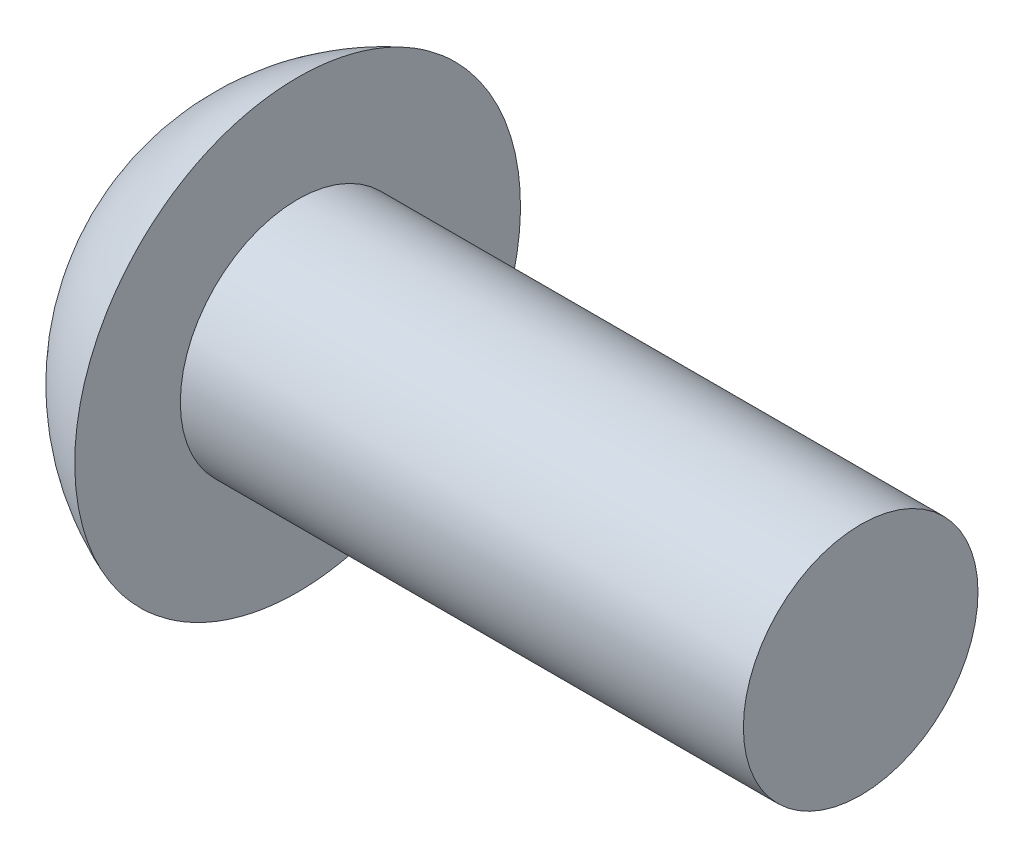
ISO-10303-21;
HEADER;
FILE_DESCRIPTION(('STEP AP214'),'2;1');
FILE_NAME('part.step','',(''),(''),'','','');
FILE_SCHEMA(('AUTOMOTIVE_DESIGN { 1 0 10303 214 1 1 1 1 }'));
ENDSEC;
DATA;
#1=APPLICATION_CONTEXT('core data for automotive mechanical design processes');
#2=APPLICATION_PROTOCOL_DEFINITION('international standard','automotive_design',2000,#1);
#3=PRODUCT_CONTEXT('',#1,'mechanical');
#4=PRODUCT('Part','Part','',(#3));
#5=PRODUCT_RELATED_PRODUCT_CATEGORY('part','',(#4));
#6=PRODUCT_DEFINITION_FORMATION('','',#4);
#7=PRODUCT_DEFINITION_CONTEXT('part definition',#1,'design');
#8=PRODUCT_DEFINITION('design','',#6,#7);
#9=PRODUCT_DEFINITION_SHAPE('','',#8);
#10=(LENGTH_UNIT() NAMED_UNIT(*) SI_UNIT(.MILLI.,.METRE.));
#11=(NAMED_UNIT(*) PLANE_ANGLE_UNIT() SI_UNIT($,.RADIAN.));
#12=(NAMED_UNIT(*) SI_UNIT($,.STERADIAN.) SOLID_ANGLE_UNIT());
#13=UNCERTAINTY_MEASURE_WITH_UNIT(LENGTH_MEASURE(1.E-05),#10,'distance_accuracy_value','');
#14=(GEOMETRIC_REPRESENTATION_CONTEXT(3) GLOBAL_UNCERTAINTY_ASSIGNED_CONTEXT((#13)) GLOBAL_UNIT_ASSIGNED_CONTEXT((#10,
#11,#12)) REPRESENTATION_CONTEXT('',''));
#15=CARTESIAN_POINT('',(0.,0.,0.));
#16=DIRECTION('',(0.,0.,1.));
#17=DIRECTION('',(1.,0.,0.));
#18=AXIS2_PLACEMENT_3D('',#15,#16,#17);
#19=CARTESIAN_POINT('',(1.56,1.5,0.866025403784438));
#20=DIRECTION('',(0.86602540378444,0.249999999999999,0.433012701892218));
#21=DIRECTION('',(0.447213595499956,0.,-0.894427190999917));
#22=AXIS2_PLACEMENT_3D('',#19,#20,#21);
#23=PLANE('',#22);
#24=DIRECTION('',(0.447213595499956,-0.774596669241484,-0.447213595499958));
#25=VECTOR('',#24,1.);
#26=CARTESIAN_POINT('',(1.56,1.5,0.866025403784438));
#27=LINE('',#26,#25);
#28=CARTESIAN_POINT('',(1.56,1.5,0.866025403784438));
#29=VERTEX_POINT('',#28);
#30=CARTESIAN_POINT('',(2.42602540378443,0.,0.));
#31=VERTEX_POINT('',#30);
#32=EDGE_CURVE('E81',#29,#31,#27,.T.);
#33=ORIENTED_EDGE('',*,*,#32,.T.);
#34=DIRECTION('',(0.447213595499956,0.,-0.894427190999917));
#35=VECTOR('',#34,1.);
#36=CARTESIAN_POINT('',(1.56,0.,1.73205080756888));
#37=LINE('',#36,#35);
#38=CARTESIAN_POINT('',(1.56,0.,1.73205080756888));
#39=VERTEX_POINT('',#38);
#40=EDGE_CURVE('E84',#31,#39,#37,.F.);
#41=ORIENTED_EDGE('',*,*,#40,.T.);
#42=DIRECTION('',(0.,-0.866025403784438,0.5));
#43=VECTOR('',#42,1.);
#44=CARTESIAN_POINT('',(1.56,1.5,0.866025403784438));
#45=LINE('',#44,#43);
#46=EDGE_CURVE('E76',#29,#39,#45,.T.);
#47=ORIENTED_EDGE('',*,*,#46,.F.);
#48=EDGE_LOOP('',(#33,#41,#47));
#49=FACE_BOUND('',#48,.T.);
#50=ADVANCED_FACE('F17',(#49),#23,.F.);
#51=CARTESIAN_POINT('',(1.56,1.5,-0.866025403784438));
#52=DIRECTION('',(0.86602540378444,0.499999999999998,0.));
#53=DIRECTION('',(-0.499999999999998,0.86602540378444,0.));
#54=AXIS2_PLACEMENT_3D('',#51,#52,#53);
#55=PLANE('',#54);
#56=DIRECTION('',(0.447213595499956,-0.774596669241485,0.447213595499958));
#57=VECTOR('',#56,1.);
#58=CARTESIAN_POINT('',(1.56,1.5,-0.866025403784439));
#59=LINE('',#58,#57);
#60=CARTESIAN_POINT('',(1.56,1.5,-0.866025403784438));
#61=VERTEX_POINT('',#60);
#62=EDGE_CURVE('E105',#61,#31,#59,.T.);
#63=ORIENTED_EDGE('',*,*,#62,.T.);
#64=ORIENTED_EDGE('',*,*,#32,.F.);
#65=DIRECTION('',(0.,0.,1.));
#66=VECTOR('',#65,1.);
#67=CARTESIAN_POINT('',(1.56,1.5,-0.866025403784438));
#68=LINE('',#67,#66);
#69=EDGE_CURVE('E90',#61,#29,#68,.T.);
#70=ORIENTED_EDGE('',*,*,#69,.F.);
#71=EDGE_LOOP('',(#63,#64,#70));
#72=FACE_BOUND('',#71,.T.);
#73=ADVANCED_FACE('F104',(#72),#55,.F.);
#74=CARTESIAN_POINT('',(1.56,0.,1.73205080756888));
#75=DIRECTION('',(0.86602540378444,-0.249999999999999,0.433012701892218));
#76=DIRECTION('',(0.447213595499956,0.,-0.894427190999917));
#77=AXIS2_PLACEMENT_3D('',#74,#75,#76);
#78=PLANE('',#77);
#79=ORIENTED_EDGE('',*,*,#40,.F.);
#80=DIRECTION('',(-0.447213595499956,-0.774596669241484,0.447213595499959));
#81=VECTOR('',#80,1.);
#82=CARTESIAN_POINT('',(2.42602540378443,0.,0.));
#83=LINE('',#82,#81);
#84=CARTESIAN_POINT('',(1.56,-1.5,0.866025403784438));
#85=VERTEX_POINT('',#84);
#86=EDGE_CURVE('E163',#31,#85,#83,.T.);
#87=ORIENTED_EDGE('',*,*,#86,.T.);
#88=DIRECTION('',(0.,-0.866025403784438,-0.5));
#89=VECTOR('',#88,1.);
#90=CARTESIAN_POINT('',(1.56,0.,1.73205080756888));
#91=LINE('',#90,#89);
#92=EDGE_CURVE('E169',#39,#85,#91,.T.);
#93=ORIENTED_EDGE('',*,*,#92,.F.);
#94=EDGE_LOOP('',(#79,#87,#93));
#95=FACE_BOUND('',#94,.T.);
#96=ADVANCED_FACE('F177',(#95),#78,.F.);
#97=CARTESIAN_POINT('',(1.56,0.,-1.73205080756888));
#98=DIRECTION('',(0.86602540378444,0.249999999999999,-0.433012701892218));
#99=DIRECTION('',(-0.447213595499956,0.,-0.894427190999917));
#100=AXIS2_PLACEMENT_3D('',#97,#98,#99);
#101=PLANE('',#100);
#102=DIRECTION('',(-0.447213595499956,0.,-0.894427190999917));
#103=VECTOR('',#102,1.);
#104=CARTESIAN_POINT('',(1.90641016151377,0.,-1.03923048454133));
#105=LINE('',#104,#103);
#106=CARTESIAN_POINT('',(1.56,0.,-1.73205080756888));
#107=VERTEX_POINT('',#106);
#108=EDGE_CURVE('E158',#107,#31,#105,.F.);
#109=ORIENTED_EDGE('',*,*,#108,.T.);
#110=ORIENTED_EDGE('',*,*,#62,.F.);
#111=DIRECTION('',(0.,0.866025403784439,0.5));
#112=VECTOR('',#111,1.);
#113=CARTESIAN_POINT('',(1.56,0.,-1.73205080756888));
#114=LINE('',#113,#112);
#115=EDGE_CURVE('E166',#107,#61,#114,.T.);
#116=ORIENTED_EDGE('',*,*,#115,.F.);
#117=EDGE_LOOP('',(#109,#110,#116));
#118=FACE_BOUND('',#117,.T.);
#119=ADVANCED_FACE('F196',(#118),#101,.F.);
#120=CARTESIAN_POINT('',(1.56,-1.5,0.866025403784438));
#121=DIRECTION('',(0.86602540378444,-0.499999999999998,0.));
#122=DIRECTION('',(0.499999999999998,0.86602540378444,0.));
#123=AXIS2_PLACEMENT_3D('',#120,#121,#122);
#124=PLANE('',#123);
#125=ORIENTED_EDGE('',*,*,#86,.F.);
#126=DIRECTION('',(-0.447213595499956,-0.774596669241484,-0.447213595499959));
#127=VECTOR('',#126,1.);
#128=CARTESIAN_POINT('',(2.42602540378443,0.,0.));
#129=LINE('',#128,#127);
#130=CARTESIAN_POINT('',(1.56,-1.5,-0.86602540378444));
#131=VERTEX_POINT('',#130);
#132=EDGE_CURVE('E155',#31,#131,#129,.T.);
#133=ORIENTED_EDGE('',*,*,#132,.T.);
#134=DIRECTION('',(0.,0.,1.));
#135=VECTOR('',#134,1.);
#136=CARTESIAN_POINT('',(1.56,-1.5,0.866025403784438));
#137=LINE('',#136,#135);
#138=EDGE_CURVE('E161',#85,#131,#137,.F.);
#139=ORIENTED_EDGE('',*,*,#138,.F.);
#140=EDGE_LOOP('',(#125,#133,#139));
#141=FACE_BOUND('',#140,.T.);
#142=ADVANCED_FACE('F184',(#141),#124,.F.);
#143=CARTESIAN_POINT('',(1.56,-1.5,-0.86602540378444));
#144=DIRECTION('',(0.86602540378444,-0.249999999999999,-0.433012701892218));
#145=DIRECTION('',(-0.447213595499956,0.,-0.894427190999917));
#146=AXIS2_PLACEMENT_3D('',#143,#144,#145);
#147=PLANE('',#146);
#148=ORIENTED_EDGE('',*,*,#132,.F.);
#149=ORIENTED_EDGE('',*,*,#108,.F.);
#150=DIRECTION('',(0.,-0.866025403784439,0.5));
#151=VECTOR('',#150,1.);
#152=CARTESIAN_POINT('',(1.56,-1.5,-0.86602540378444));
#153=LINE('',#152,#151);
#154=EDGE_CURVE('E144',#131,#107,#153,.F.);
#155=ORIENTED_EDGE('',*,*,#154,.F.);
#156=EDGE_LOOP('',(#148,#149,#155));
#157=FACE_BOUND('',#156,.T.);
#158=ADVANCED_FACE('F188',(#157),#147,.F.);
#159=CARTESIAN_POINT('',(1.56,-1.5,0.866025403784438));
#160=DIRECTION('',(0.,1.,0.));
#161=DIRECTION('',(0.,0.,1.));
#162=AXIS2_PLACEMENT_3D('',#159,#160,#161);
#163=PLANE('',#162);
#164=ORIENTED_EDGE('',*,*,#138,.T.);
#165=DIRECTION('',(1.,0.,0.));
#166=VECTOR('',#165,1.);
#167=CARTESIAN_POINT('',(1.56,-1.5,-0.86602540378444));
#168=LINE('',#167,#166);
#169=CARTESIAN_POINT('',(0.,-1.5,-0.86602540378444));
#170=VERTEX_POINT('',#169);
#171=EDGE_CURVE('E147',#170,#131,#168,.T.);
#172=ORIENTED_EDGE('',*,*,#171,.F.);
#173=DIRECTION('',(0.,0.,-1.));
#174=VECTOR('',#173,1.);
#175=CARTESIAN_POINT('',(0.,-1.5,0.));
#176=LINE('',#175,#174);
#177=CARTESIAN_POINT('',(0.,-1.5,0.866025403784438));
#178=VERTEX_POINT('',#177);
#179=EDGE_CURVE('E140',#170,#178,#176,.F.);
#180=ORIENTED_EDGE('',*,*,#179,.T.);
#181=DIRECTION('',(1.,0.,0.));
#182=VECTOR('',#181,1.);
#183=CARTESIAN_POINT('',(1.56,-1.5,0.866025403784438));
#184=LINE('',#183,#182);
#185=EDGE_CURVE('E152',#85,#178,#184,.F.);
#186=ORIENTED_EDGE('',*,*,#185,.F.);
#187=EDGE_LOOP('',(#164,#172,#180,#186));
#188=FACE_BOUND('',#187,.T.);
#189=ADVANCED_FACE('F182',(#188),#163,.T.);
#190=CARTESIAN_POINT('',(1.56,0.,1.73205080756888));
#191=DIRECTION('',(0.,0.5,-0.866025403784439));
#192=DIRECTION('',(0.,0.866025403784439,0.5));
#193=AXIS2_PLACEMENT_3D('',#190,#191,#192);
#194=PLANE('',#193);
#195=ORIENTED_EDGE('',*,*,#92,.T.);
#196=ORIENTED_EDGE('',*,*,#185,.T.);
#197=DIRECTION('',(0.,0.866025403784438,0.5));
#198=VECTOR('',#197,1.);
#199=CARTESIAN_POINT('',(0.,-1.5,0.866025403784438));
#200=LINE('',#199,#198);
#201=CARTESIAN_POINT('',(0.,0.,1.73205080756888));
#202=VERTEX_POINT('',#201);
#203=EDGE_CURVE('E138',#178,#202,#200,.T.);
#204=ORIENTED_EDGE('',*,*,#203,.T.);
#205=DIRECTION('',(1.,0.,0.));
#206=VECTOR('',#205,1.);
#207=CARTESIAN_POINT('',(1.56,0.,1.73205080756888));
#208=LINE('',#207,#206);
#209=EDGE_CURVE('E102',#39,#202,#208,.F.);
#210=ORIENTED_EDGE('',*,*,#209,.F.);
#211=EDGE_LOOP('',(#195,#196,#204,#210));
#212=FACE_BOUND('',#211,.T.);
#213=ADVANCED_FACE('F172',(#212),#194,.T.);
#214=CARTESIAN_POINT('',(1.56,1.5,0.866025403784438));
#215=DIRECTION('',(0.,-0.5,-0.866025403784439));
#216=DIRECTION('',(0.,0.866025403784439,-0.5));
#217=AXIS2_PLACEMENT_3D('',#214,#215,#216);
#218=PLANE('',#217);
#219=ORIENTED_EDGE('',*,*,#46,.T.);
#220=ORIENTED_EDGE('',*,*,#209,.T.);
#221=DIRECTION('',(0.,0.866025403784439,-0.5));
#222=VECTOR('',#221,1.);
#223=CARTESIAN_POINT('',(0.,0.,1.73205080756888));
#224=LINE('',#223,#222);
#225=CARTESIAN_POINT('',(0.,1.5,0.866025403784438));
#226=VERTEX_POINT('',#225);
#227=EDGE_CURVE('E101',#202,#226,#224,.T.);
#228=ORIENTED_EDGE('',*,*,#227,.T.);
#229=DIRECTION('',(1.,0.,0.));
#230=VECTOR('',#229,1.);
#231=CARTESIAN_POINT('',(1.56,1.5,0.866025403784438));
#232=LINE('',#231,#230);
#233=EDGE_CURVE('E92',#29,#226,#232,.F.);
#234=ORIENTED_EDGE('',*,*,#233,.F.);
#235=EDGE_LOOP('',(#219,#220,#228,#234));
#236=FACE_BOUND('',#235,.T.);
#237=ADVANCED_FACE('F99',(#236),#218,.T.);
#238=CARTESIAN_POINT('',(1.56,1.5,-0.866025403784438));
#239=DIRECTION('',(0.,-1.,0.));
#240=DIRECTION('',(0.,0.,-1.));
#241=AXIS2_PLACEMENT_3D('',#238,#239,#240);
#242=PLANE('',#241);
#243=ORIENTED_EDGE('',*,*,#69,.T.);
#244=ORIENTED_EDGE('',*,*,#233,.T.);
#245=DIRECTION('',(0.,0.,-1.));
#246=VECTOR('',#245,1.);
#247=CARTESIAN_POINT('',(0.,1.5,0.));
#248=LINE('',#247,#246);
#249=CARTESIAN_POINT('',(0.,1.5,-0.866025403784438));
#250=VERTEX_POINT('',#249);
#251=EDGE_CURVE('E135',#226,#250,#248,.T.);
#252=ORIENTED_EDGE('',*,*,#251,.T.);
#253=DIRECTION('',(1.,0.,0.));
#254=VECTOR('',#253,1.);
#255=CARTESIAN_POINT('',(1.56,1.5,-0.866025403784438));
#256=LINE('',#255,#254);
#257=EDGE_CURVE('E94',#61,#250,#256,.F.);
#258=ORIENTED_EDGE('',*,*,#257,.F.);
#259=EDGE_LOOP('',(#243,#244,#252,#258));
#260=FACE_BOUND('',#259,.T.);
#261=ADVANCED_FACE('F91',(#260),#242,.T.);
#262=CARTESIAN_POINT('',(1.56,0.,-1.73205080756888));
#263=DIRECTION('',(0.,-0.5,0.866025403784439));
#264=DIRECTION('',(0.,-0.866025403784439,-0.5));
#265=AXIS2_PLACEMENT_3D('',#262,#263,#264);
#266=PLANE('',#265);
#267=ORIENTED_EDGE('',*,*,#115,.T.);
#268=ORIENTED_EDGE('',*,*,#257,.T.);
#269=DIRECTION('',(0.,-0.866025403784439,-0.5));
#270=VECTOR('',#269,1.);
#271=CARTESIAN_POINT('',(0.,1.5,-0.866025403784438));
#272=LINE('',#271,#270);
#273=CARTESIAN_POINT('',(0.,0.,-1.73205080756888));
#274=VERTEX_POINT('',#273);
#275=EDGE_CURVE('E39',#250,#274,#272,.T.);
#276=ORIENTED_EDGE('',*,*,#275,.T.);
#277=DIRECTION('',(1.,0.,0.));
#278=VECTOR('',#277,1.);
#279=CARTESIAN_POINT('',(1.56,0.,-1.73205080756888));
#280=LINE('',#279,#278);
#281=EDGE_CURVE('E142',#107,#274,#280,.F.);
#282=ORIENTED_EDGE('',*,*,#281,.F.);
#283=EDGE_LOOP('',(#267,#268,#276,#282));
#284=FACE_BOUND('',#283,.T.);
#285=ADVANCED_FACE('F194',(#284),#266,.T.);
#286=CARTESIAN_POINT('',(1.56,-1.5,-0.86602540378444));
#287=DIRECTION('',(0.,0.5,0.866025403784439));
#288=DIRECTION('',(0.,-0.866025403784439,0.5));
#289=AXIS2_PLACEMENT_3D('',#286,#287,#288);
#290=PLANE('',#289);
#291=ORIENTED_EDGE('',*,*,#154,.T.);
#292=ORIENTED_EDGE('',*,*,#281,.T.);
#293=DIRECTION('',(0.,-0.866025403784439,0.5));
#294=VECTOR('',#293,1.);
#295=CARTESIAN_POINT('',(0.,0.,-1.73205080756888));
#296=LINE('',#295,#294);
#297=EDGE_CURVE('E131',#274,#170,#296,.T.);
#298=ORIENTED_EDGE('',*,*,#297,.T.);
#299=ORIENTED_EDGE('',*,*,#171,.T.);
#300=EDGE_LOOP('',(#291,#292,#298,#299));
#301=FACE_BOUND('',#300,.T.);
#302=ADVANCED_FACE('F190',(#301),#290,.T.);
#303=CARTESIAN_POINT('',(0.,0.,0.));
#304=DIRECTION('',(1.,0.,0.));
#305=DIRECTION('',(0.,0.,-1.));
#306=AXIS2_PLACEMENT_3D('',#303,#304,#305);
#307=PLANE('',#306);
#308=ORIENTED_EDGE('',*,*,#275,.F.);
#309=ORIENTED_EDGE('',*,*,#251,.F.);
#310=ORIENTED_EDGE('',*,*,#227,.F.);
#311=ORIENTED_EDGE('',*,*,#203,.F.);
#312=ORIENTED_EDGE('',*,*,#179,.F.);
#313=ORIENTED_EDGE('',*,*,#297,.F.);
#314=EDGE_LOOP('',(#308,#309,#310,#311,#312,#313));
#315=FACE_BOUND('',#314,.T.);
#316=CARTESIAN_POINT('',(0.,2.22,0.));
#317=CARTESIAN_POINT('',(0.,2.21999962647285,0.062330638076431));
#318=CARTESIAN_POINT('',(0.,2.21737257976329,0.124672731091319));
#319=CARTESIAN_POINT('',(0.,2.20688147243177,0.248926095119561));
#320=CARTESIAN_POINT('',(1.12668213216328E-13,2.19901586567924,0.310837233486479));
#321=CARTESIAN_POINT('',(-1.12847492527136E-13,2.17808302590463,0.433881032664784));
#322=CARTESIAN_POINT('',(-4.21828668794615E-13,2.16500753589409,0.495012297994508));
#323=CARTESIAN_POINT('',(4.22171699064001E-13,2.13374506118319,0.61599000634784));
#324=CARTESIAN_POINT('',(1.57634231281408E-12,2.1155539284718,0.675835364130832));
#325=CARTESIAN_POINT('',(2.62227995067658E-12,2.05355856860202,0.852545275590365));
#326=CARTESIAN_POINT('',(1.144678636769E-13,2.00228145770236,0.966881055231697));
#327=CARTESIAN_POINT('',(-1.14472215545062E-13,1.88123251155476,1.18530835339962));
#328=CARTESIAN_POINT('',(2.1645817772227E-12,1.81145997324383,1.28939948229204));
#329=CARTESIAN_POINT('',(1.34249360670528E-12,1.69451804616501,1.43559115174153));
#330=CARTESIAN_POINT('',(3.5965321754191E-13,1.65345934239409,1.48269174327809));
#331=CARTESIAN_POINT('',(-3.59306457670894E-13,1.56755242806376,1.57323416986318));
#332=CARTESIAN_POINT('',(0.,1.52270790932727,1.61667948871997));
#333=CARTESIAN_POINT('',(0.,1.42949688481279,1.69965687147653));
#334=CARTESIAN_POINT('',(0.,1.38112879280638,1.73918715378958));
#335=CARTESIAN_POINT('',(0.,1.28123883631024,1.8140365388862));
#336=CARTESIAN_POINT('',(0.,1.22971624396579,1.8493546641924));
#337=CARTESIAN_POINT('',(0.,1.0709785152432,1.94857305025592));
#338=CARTESIAN_POINT('',(0.,0.959494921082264,2.00582485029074));
#339=CARTESIAN_POINT('',(0.,0.728558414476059,2.10076448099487));
#340=CARTESIAN_POINT('',(0.,0.609105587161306,2.13845252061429));
#341=CARTESIAN_POINT('',(0.,0.365552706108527,2.19324936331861));
#342=CARTESIAN_POINT('',(0.,0.241452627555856,2.21035805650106));
#343=CARTESIAN_POINT('',(0.,-0.00785825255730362,2.22349282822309));
#344=CARTESIAN_POINT('',(0.,-0.133069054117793,2.21951890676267));
#345=CARTESIAN_POINT('',(0.,-0.381031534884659,2.19061721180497));
#346=CARTESIAN_POINT('',(0.,-0.503783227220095,2.16568955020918));
#347=CARTESIAN_POINT('',(0.,-0.743417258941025,2.09554160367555));
#348=CARTESIAN_POINT('',(0.,-0.860299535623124,2.05032110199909));
#349=CARTESIAN_POINT('',(0.,-1.02858407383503,1.96833165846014));
#350=CARTESIAN_POINT('',(0.,-1.08353256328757,1.93862288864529));
#351=CARTESIAN_POINT('',(0.,-1.19073448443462,1.87468399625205));
#352=CARTESIAN_POINT('',(0.,-1.24298853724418,1.84045492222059));
#353=CARTESIAN_POINT('',(0.,-1.34440256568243,1.76773122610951));
#354=CARTESIAN_POINT('',(0.,-1.39356393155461,1.72923854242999));
#355=CARTESIAN_POINT('',(0.,-1.48850919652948,1.64822418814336));
#356=CARTESIAN_POINT('',(0.,-1.53428979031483,1.6056986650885));
#357=CARTESIAN_POINT('',(0.,-1.66594571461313,1.47260420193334));
#358=CARTESIAN_POINT('',(0.,-1.74626957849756,1.3764207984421));
#359=CARTESIAN_POINT('',(0.,-1.88960008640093,1.17192214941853));
#360=CARTESIAN_POINT('',(0.,-1.95260738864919,1.0636073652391));
#361=CARTESIAN_POINT('',(0.,-2.03282768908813,0.89438998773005));
#362=CARTESIAN_POINT('',(0.,-2.05720648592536,0.836787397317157));
#363=CARTESIAN_POINT('',(0.,-2.10100786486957,0.719764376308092));
#364=CARTESIAN_POINT('',(0.,-2.12043445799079,0.660345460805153));
#365=CARTESIAN_POINT('',(0.,-2.15418048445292,0.540182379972));
#366=CARTESIAN_POINT('',(0.,-2.1685079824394,0.479440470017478));
#367=CARTESIAN_POINT('',(0.,-2.19199717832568,0.35697733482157));
#368=CARTESIAN_POINT('',(0.,-2.20116039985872,0.295256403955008));
#369=CARTESIAN_POINT('',(0.,-2.21180361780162,0.194533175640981));
#370=CARTESIAN_POINT('',(0.,-2.21487628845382,0.155692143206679));
#371=CARTESIAN_POINT('',(0.,-2.21897459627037,0.077902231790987));
#372=CARTESIAN_POINT('',(0.,-2.22000023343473,0.0389533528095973));
#373=CARTESIAN_POINT('',(0.,-2.21999962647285,-0.0623306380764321));
#374=CARTESIAN_POINT('',(0.,-2.2173725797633,-0.12467273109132));
#375=CARTESIAN_POINT('',(0.,-2.20688147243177,-0.248926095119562));
#376=CARTESIAN_POINT('',(1.12647015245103E-13,-2.19901586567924,-0.31083723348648));
#377=CARTESIAN_POINT('',(-1.12826260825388E-13,-2.17808302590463,-0.433881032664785));
#378=CARTESIAN_POINT('',(-4.21852479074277E-13,-2.16500753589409,-0.49501229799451));
#379=CARTESIAN_POINT('',(4.22195528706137E-13,-2.1337450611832,-0.615990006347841));
#380=CARTESIAN_POINT('',(1.57645893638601E-12,-2.1155539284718,-0.675835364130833));
#381=CARTESIAN_POINT('',(2.62204725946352E-12,-2.05355856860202,-0.852545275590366));
#382=CARTESIAN_POINT('',(1.13168799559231E-13,-2.00228145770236,-0.966881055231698));
#383=CARTESIAN_POINT('',(-1.13173102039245E-13,-1.88123251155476,-1.18530835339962));
#384=CARTESIAN_POINT('',(2.16954562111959E-12,-1.81145997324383,-1.28939948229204));
#385=CARTESIAN_POINT('',(1.34521487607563E-12,-1.69451804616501,-1.43559115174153));
#386=CARTESIAN_POINT('',(3.6033314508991E-13,-1.6534593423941,-1.48269174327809));
#387=CARTESIAN_POINT('',(-3.59985729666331E-13,-1.56755242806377,-1.57323416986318));
#388=CARTESIAN_POINT('',(0.,-1.52270790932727,-1.61667948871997));
#389=CARTESIAN_POINT('',(0.,-1.42949688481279,-1.69965687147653));
#390=CARTESIAN_POINT('',(0.,-1.38112879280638,-1.73918715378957));
#391=CARTESIAN_POINT('',(0.,-1.28123883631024,-1.8140365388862));
#392=CARTESIAN_POINT('',(0.,-1.22971624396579,-1.8493546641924));
#393=CARTESIAN_POINT('',(0.,-1.07097851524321,-1.94857305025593));
#394=CARTESIAN_POINT('',(0.,-0.959494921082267,-2.00582485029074));
#395=CARTESIAN_POINT('',(0.,-0.72855841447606,-2.10076448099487));
#396=CARTESIAN_POINT('',(0.,-0.609105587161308,-2.13845252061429));
#397=CARTESIAN_POINT('',(0.,-0.365552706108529,-2.19324936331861));
#398=CARTESIAN_POINT('',(0.,-0.241452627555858,-2.21035805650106));
#399=CARTESIAN_POINT('',(0.,0.00785825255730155,-2.22349282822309));
#400=CARTESIAN_POINT('',(0.,0.13306905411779,-2.21951890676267));
#401=CARTESIAN_POINT('',(0.,0.381031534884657,-2.19061721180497));
#402=CARTESIAN_POINT('',(0.,0.503783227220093,-2.16568955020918));
#403=CARTESIAN_POINT('',(0.,0.743417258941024,-2.09554160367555));
#404=CARTESIAN_POINT('',(0.,0.860299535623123,-2.05032110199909));
#405=CARTESIAN_POINT('',(0.,1.02858407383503,-1.96833165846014));
#406=CARTESIAN_POINT('',(0.,1.08353256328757,-1.93862288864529));
#407=CARTESIAN_POINT('',(0.,1.19073448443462,-1.87468399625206));
#408=CARTESIAN_POINT('',(0.,1.24298853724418,-1.84045492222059));
#409=CARTESIAN_POINT('',(0.,1.34440256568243,-1.76773122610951));
#410=CARTESIAN_POINT('',(0.,1.39356393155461,-1.72923854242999));
#411=CARTESIAN_POINT('',(0.,1.48850919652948,-1.64822418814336));
#412=CARTESIAN_POINT('',(0.,1.53428979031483,-1.6056986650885));
#413=CARTESIAN_POINT('',(0.,1.66594571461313,-1.47260420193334));
#414=CARTESIAN_POINT('',(0.,1.74626957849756,-1.3764207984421));
#415=CARTESIAN_POINT('',(0.,1.88960008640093,-1.17192214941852));
#416=CARTESIAN_POINT('',(0.,1.95260738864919,-1.0636073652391));
#417=CARTESIAN_POINT('',(0.,2.03282768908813,-0.894389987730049));
#418=CARTESIAN_POINT('',(0.,2.05720648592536,-0.836787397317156));
#419=CARTESIAN_POINT('',(0.,2.10100786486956,-0.71976437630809));
#420=CARTESIAN_POINT('',(0.,2.12043445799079,-0.660345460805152));
#421=CARTESIAN_POINT('',(0.,2.15418048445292,-0.540182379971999));
#422=CARTESIAN_POINT('',(0.,2.1685079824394,-0.479440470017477));
#423=CARTESIAN_POINT('',(0.,2.19199717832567,-0.356977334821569));
#424=CARTESIAN_POINT('',(0.,2.20116039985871,-0.295256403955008));
#425=CARTESIAN_POINT('',(0.,2.21180361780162,-0.194533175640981));
#426=CARTESIAN_POINT('',(0.,2.21487628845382,-0.155692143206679));
#427=CARTESIAN_POINT('',(0.,2.21897459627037,-0.0779022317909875));
#428=CARTESIAN_POINT('',(0.,2.22000023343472,-0.0389533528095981));
#429=CARTESIAN_POINT('',(0.,2.22,0.));
#430=B_SPLINE_CURVE_WITH_KNOTS('',3,(#316,#317,#318,#319,#320,#321,#322,#323,#324,#325,#326,
#327,#328,#329,#330,#331,#332,#333,#334,#335,#336,#337,#338,#339,#340,#341,#342,#343,#344,#345,
#346,#347,#348,#349,#350,#351,#352,#353,#354,#355,#356,#357,#358,#359,#360,#361,#362,#363,#364,
#365,#366,#367,#368,#369,#370,#371,#372,#373,#374,#375,#376,#377,#378,#379,#380,#381,#382,#383,
#384,#385,#386,#387,#388,#389,#390,#391,#392,#393,#394,#395,#396,#397,#398,#399,#400,#401,#402,
#403,#404,#405,#406,#407,#408,#409,#410,#411,#412,#413,#414,#415,#416,#417,#418,#419,#420,#421,
#422,#423,#424,#425,#426,#427,#428,#429),.UNSPECIFIED.,.T.,.F.,(4,2,2,2,2,2,2,2,2,2,2,2,2,2,2,2,
2,2,2,2,2,2,2,2,2,2,2,2,2,2,2,2,2,2,2,2,2,2,2,2,2,2,2,2,2,2,2,2,2,2,2,2,2,2,2,2,4),(0.,
0.186956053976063,0.3739673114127,0.561276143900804,0.748737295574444,1.12276599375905,
1.49680891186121,1.68407543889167,1.87116141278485,2.05833213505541,2.24554620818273,
2.61958401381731,2.993617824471,3.36765363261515,3.74168944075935,4.11572325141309,
4.48976105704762,4.67697513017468,4.86414585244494,5.0512318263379,5.23849835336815,
5.61254127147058,5.98656996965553,6.17403112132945,6.36133995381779,6.54835121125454,
6.73530726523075,6.85214491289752,6.9689825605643,7.15593861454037,7.342949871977,
7.53025870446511,7.71771985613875,8.09174855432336,8.46579147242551,8.65305799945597,
8.84014397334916,9.02731469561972,9.21452876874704,9.58856657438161,9.96260038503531,
10.3366361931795,10.7106720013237,11.0847058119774,11.4587436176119,11.645957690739,
11.8331284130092,12.0202143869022,12.2074809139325,12.5815238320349,12.9555525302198,
13.1430136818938,13.3303225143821,13.5173337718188,13.7042898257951,13.8211274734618,
13.9379651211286),.UNSPECIFIED.);
#431=CARTESIAN_POINT('',(0.,2.22,0.));
#432=VERTEX_POINT('',#431);
#433=EDGE_CURVE('E20',#432,#432,#430,.T.);
#434=ORIENTED_EDGE('',*,*,#433,.F.);
#435=EDGE_LOOP('',(#434));
#436=FACE_BOUND('',#435,.T.);
#437=ADVANCED_FACE('F124',(#315,#436),#307,.F.);
#438=CARTESIAN_POINT('',(4.5812,0.,0.));
#439=DIRECTION('',(0.,1.,0.));
#440=DIRECTION('',(1.,0.,0.));
#441=AXIS2_PLACEMENT_3D('',#438,#439,#440);
#442=SPHERICAL_SURFACE('',#441,5.09075568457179);
#443=CARTESIAN_POINT('',(2.75,4.75,0.));
#444=CARTESIAN_POINT('',(2.75,4.74999920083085,0.13336510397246));
#445=CARTESIAN_POINT('',(2.75,4.74437826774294,0.266754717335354));
#446=CARTESIAN_POINT('',(2.75,4.72193107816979,0.532612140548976));
#447=CARTESIAN_POINT('',(2.75,4.70510151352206,0.665079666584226));
#448=CARTESIAN_POINT('',(2.75,4.66031278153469,0.928349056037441));
#449=CARTESIAN_POINT('',(2.75,4.63233594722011,1.05914793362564));
#450=CARTESIAN_POINT('',(2.75,4.56544551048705,1.3179966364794));
#451=CARTESIAN_POINT('',(2.75,4.52652303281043,1.44604413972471));
#452=CARTESIAN_POINT('',(2.75,4.39387534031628,1.82413965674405));
#453=CARTESIAN_POINT('',(2.75,4.28416091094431,2.06877698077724));
#454=CARTESIAN_POINT('',(2.75,4.02515951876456,2.53613278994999));
#455=CARTESIAN_POINT('',(2.75,3.87587105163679,2.75885044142));
#456=CARTESIAN_POINT('',(2.75,3.62565823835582,3.07164763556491));
#457=CARTESIAN_POINT('',(2.75,3.53780788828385,3.17242574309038));
#458=CARTESIAN_POINT('',(2.75,3.35399657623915,3.36615447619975));
#459=CARTESIAN_POINT('',(2.75,3.25804351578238,3.45911255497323));
#460=CARTESIAN_POINT('',(2.75,3.05861088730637,3.636652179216));
#461=CARTESIAN_POINT('',(2.75,2.95512792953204,3.72122991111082));
#462=CARTESIAN_POINT('',(2.75,2.74137938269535,3.88138835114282));
#463=CARTESIAN_POINT('',(2.75,2.63111222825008,3.95696697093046));
#464=CARTESIAN_POINT('',(2.75,2.40464009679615,4.09854037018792));
#465=CARTESIAN_POINT('',(2.75,2.28843713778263,4.16453837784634));
#466=CARTESIAN_POINT('',(2.75,2.05084380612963,4.28653497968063));
#467=CARTESIAN_POINT('',(2.75,1.92945153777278,4.34252988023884));
#468=CARTESIAN_POINT('',(2.75,1.68241883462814,4.44407312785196));
#469=CARTESIAN_POINT('',(2.75,1.5567800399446,4.48962545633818));
#470=CARTESIAN_POINT('',(2.75,1.30209840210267,4.57000003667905));
#471=CARTESIAN_POINT('',(2.75,1.17305430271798,4.60481826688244));
#472=CARTESIAN_POINT('',(2.75,0.782298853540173,4.69272179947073));
#473=CARTESIAN_POINT('',(2.75,0.516696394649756,4.72936577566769));
#474=CARTESIAN_POINT('',(2.75,-0.0168886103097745,4.75747733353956));
#475=CARTESIAN_POINT('',(2.75,-0.284871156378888,4.74894491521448));
#476=CARTESIAN_POINT('',(2.75,-0.682700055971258,4.70258740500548));
#477=CARTESIAN_POINT('',(2.75,-0.814688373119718,4.68152148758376));
#478=CARTESIAN_POINT('',(2.75,-1.07640563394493,4.62835302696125));
#479=CARTESIAN_POINT('',(2.75,-1.20613540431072,4.59625461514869));
#480=CARTESIAN_POINT('',(2.75,-1.46247041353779,4.52123094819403));
#481=CARTESIAN_POINT('',(2.75,-1.58907443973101,4.47830156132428));
#482=CARTESIAN_POINT('',(2.75,-1.83817150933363,4.38194590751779));
#483=CARTESIAN_POINT('',(2.75,-1.96066604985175,4.32852351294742));
#484=CARTESIAN_POINT('',(2.75,-2.20076055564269,4.21153085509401));
#485=CARTESIAN_POINT('',(2.75,-2.31835885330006,4.14795716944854));
#486=CARTESIAN_POINT('',(2.75,-2.54775307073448,4.01114540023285));
#487=CARTESIAN_POINT('',(2.75,-2.65955032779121,3.93790955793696));
#488=CARTESIAN_POINT('',(2.75,-2.8765342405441,3.78230855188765));
#489=CARTESIAN_POINT('',(2.75,-2.98172386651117,3.69994753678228));
#490=CARTESIAN_POINT('',(2.75,-3.1848740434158,3.52660560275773));
#491=CARTESIAN_POINT('',(2.75,-3.28282751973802,3.43561644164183));
#492=CARTESIAN_POINT('',(2.75,-3.56452295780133,3.15084246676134));
#493=CARTESIAN_POINT('',(2.75,-3.73638747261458,2.94504453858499));
#494=CARTESIAN_POINT('',(2.75,-4.04306338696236,2.50749104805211));
#495=CARTESIAN_POINT('',(2.75,-4.17787619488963,2.27573647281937));
#496=CARTESIAN_POINT('',(2.75,-4.34951869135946,1.91367227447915));
#497=CARTESIAN_POINT('',(2.75,-4.40168054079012,1.79042348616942));
#498=CARTESIAN_POINT('',(2.75,-4.49539971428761,1.54003638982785));
#499=CARTESIAN_POINT('',(2.75,-4.53696562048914,1.41290132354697));
#500=CARTESIAN_POINT('',(2.75,-4.60916995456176,1.1557956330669));
#501=CARTESIAN_POINT('',(2.75,-4.63982563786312,1.0258298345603));
#502=CARTESIAN_POINT('',(2.75,-4.69008405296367,0.763802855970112));
#503=CARTESIAN_POINT('',(2.75,-4.7096900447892,0.631742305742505));
#504=CARTESIAN_POINT('',(2.75,-4.73246269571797,0.416230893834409));
#505=CARTESIAN_POINT('',(2.75,-4.73903710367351,0.333125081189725));
#506=CARTESIAN_POINT('',(2.75,-4.74780600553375,0.166682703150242));
#507=CARTESIAN_POINT('',(2.75000000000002,-4.75000049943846,0.0833461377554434));
#508=CARTESIAN_POINT('',(2.75000000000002,-4.74999920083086,-0.133365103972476));
#509=CARTESIAN_POINT('',(2.75000000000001,-4.74437826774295,-0.266754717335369));
#510=CARTESIAN_POINT('',(2.74999999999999,-4.72193107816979,-0.532612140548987));
#511=CARTESIAN_POINT('',(2.75,-4.70510151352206,-0.665079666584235));
#512=CARTESIAN_POINT('',(2.75,-4.66031278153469,-0.928349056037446));
#513=CARTESIAN_POINT('',(2.75,-4.63233594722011,-1.05914793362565));
#514=CARTESIAN_POINT('',(2.75,-4.56544551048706,-1.3179966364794));
#515=CARTESIAN_POINT('',(2.75,-4.52652303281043,-1.44604413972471));
#516=CARTESIAN_POINT('',(2.75,-4.39387534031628,-1.82413965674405));
#517=CARTESIAN_POINT('',(2.75,-4.28416091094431,-2.06877698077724));
#518=CARTESIAN_POINT('',(2.75,-4.02515951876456,-2.53613278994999));
#519=CARTESIAN_POINT('',(2.75,-3.8758710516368,-2.75885044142));
#520=CARTESIAN_POINT('',(2.75,-3.62565823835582,-3.07164763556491));
#521=CARTESIAN_POINT('',(2.75,-3.53780788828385,-3.17242574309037));
#522=CARTESIAN_POINT('',(2.75,-3.35399657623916,-3.36615447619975));
#523=CARTESIAN_POINT('',(2.75,-3.25804351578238,-3.45911255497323));
#524=CARTESIAN_POINT('',(2.75,-3.05861088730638,-3.636652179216));
#525=CARTESIAN_POINT('',(2.75,-2.95512792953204,-3.72122991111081));
#526=CARTESIAN_POINT('',(2.75,-2.74137938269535,-3.88138835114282));
#527=CARTESIAN_POINT('',(2.75,-2.63111222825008,-3.95696697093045));
#528=CARTESIAN_POINT('',(2.75,-2.40464009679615,-4.09854037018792));
#529=CARTESIAN_POINT('',(2.75,-2.28843713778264,-4.16453837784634));
#530=CARTESIAN_POINT('',(2.75,-2.05084380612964,-4.28653497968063));
#531=CARTESIAN_POINT('',(2.75,-1.92945153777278,-4.34252988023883));
#532=CARTESIAN_POINT('',(2.75,-1.68241883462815,-4.44407312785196));
#533=CARTESIAN_POINT('',(2.75,-1.5567800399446,-4.48962545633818));
#534=CARTESIAN_POINT('',(2.75,-1.30209840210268,-4.57000003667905));
#535=CARTESIAN_POINT('',(2.75,-1.17305430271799,-4.60481826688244));
#536=CARTESIAN_POINT('',(2.75,-0.78229885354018,-4.69272179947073));
#537=CARTESIAN_POINT('',(2.75,-0.516696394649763,-4.72936577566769));
#538=CARTESIAN_POINT('',(2.75,0.0168886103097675,-4.75747733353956));
#539=CARTESIAN_POINT('',(2.75,0.284871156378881,-4.74894491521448));
#540=CARTESIAN_POINT('',(2.75,0.682700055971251,-4.70258740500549));
#541=CARTESIAN_POINT('',(2.75,0.814688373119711,-4.68152148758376));
#542=CARTESIAN_POINT('',(2.75,1.07640563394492,-4.62835302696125));
#543=CARTESIAN_POINT('',(2.75,1.20613540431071,-4.59625461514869));
#544=CARTESIAN_POINT('',(2.75,1.46247041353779,-4.52123094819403));
#545=CARTESIAN_POINT('',(2.75,1.589074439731,-4.47830156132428));
#546=CARTESIAN_POINT('',(2.75,1.83817150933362,-4.38194590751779));
#547=CARTESIAN_POINT('',(2.75,1.96066604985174,-4.32852351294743));
#548=CARTESIAN_POINT('',(2.75,2.20076055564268,-4.21153085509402));
#549=CARTESIAN_POINT('',(2.75,2.31835885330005,-4.14795716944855));
#550=CARTESIAN_POINT('',(2.75,2.54775307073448,-4.01114540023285));
#551=CARTESIAN_POINT('',(2.75,2.6595503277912,-3.93790955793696));
#552=CARTESIAN_POINT('',(2.75,2.87653424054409,-3.78230855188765));
#553=CARTESIAN_POINT('',(2.75,2.98172386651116,-3.69994753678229));
#554=CARTESIAN_POINT('',(2.75,3.1848740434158,-3.52660560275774));
#555=CARTESIAN_POINT('',(2.75,3.28282751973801,-3.43561644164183));
#556=CARTESIAN_POINT('',(2.75,3.56452295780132,-3.15084246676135));
#557=CARTESIAN_POINT('',(2.75,3.73638747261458,-2.945044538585));
#558=CARTESIAN_POINT('',(2.75,4.04306338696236,-2.50749104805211));
#559=CARTESIAN_POINT('',(2.75,4.17787619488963,-2.27573647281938));
#560=CARTESIAN_POINT('',(2.75,4.34951869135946,-1.91367227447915));
#561=CARTESIAN_POINT('',(2.75,4.40168054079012,-1.79042348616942));
#562=CARTESIAN_POINT('',(2.75,4.49539971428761,-1.54003638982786));
#563=CARTESIAN_POINT('',(2.75,4.53696562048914,-1.41290132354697));
#564=CARTESIAN_POINT('',(2.75,4.60916995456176,-1.1557956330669));
#565=CARTESIAN_POINT('',(2.75,4.63982563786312,-1.0258298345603));
#566=CARTESIAN_POINT('',(2.75,4.69008405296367,-0.763802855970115));
#567=CARTESIAN_POINT('',(2.75,4.7096900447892,-0.631742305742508));
#568=CARTESIAN_POINT('',(2.75,4.73246269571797,-0.416230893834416));
#569=CARTESIAN_POINT('',(2.75,4.7390371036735,-0.333125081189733));
#570=CARTESIAN_POINT('',(2.75,4.74780600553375,-0.166682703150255));
#571=CARTESIAN_POINT('',(2.75,4.75000049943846,-0.0833461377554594));
#572=CARTESIAN_POINT('',(2.75,4.75,0.));
#573=B_SPLINE_CURVE_WITH_KNOTS('',3,(#443,#444,#445,#446,#447,#448,#449,#450,#451,#452,#453,
#454,#455,#456,#457,#458,#459,#460,#461,#462,#463,#464,#465,#466,#467,#468,#469,#470,#471,#472,
#473,#474,#475,#476,#477,#478,#479,#480,#481,#482,#483,#484,#485,#486,#487,#488,#489,#490,#491,
#492,#493,#494,#495,#496,#497,#498,#499,#500,#501,#502,#503,#504,#505,#506,#507,#508,#509,#510,
#511,#512,#513,#514,#515,#516,#517,#518,#519,#520,#521,#522,#523,#524,#525,#526,#527,#528,#529,
#530,#531,#532,#533,#534,#535,#536,#537,#538,#539,#540,#541,#542,#543,#544,#545,#546,#547,#548,
#549,#550,#551,#552,#553,#554,#555,#556,#557,#558,#559,#560,#561,#562,#563,#564,#565,#566,#567,
#568,#569,#570,#571,#572),.UNSPECIFIED.,.T.,.F.,(4,2,2,2,2,2,2,2,2,2,2,2,2,2,2,2,2,2,2,2,2,2,2,
2,2,2,2,2,2,2,2,2,2,2,2,2,2,2,2,2,2,2,2,2,2,2,2,2,2,2,2,2,2,2,2,2,2,2,2,2,2,2,2,2,4),(0.,
0.400018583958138,0.800155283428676,1.20092868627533,1.60202799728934,2.40231462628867,
3.20263168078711,3.60331456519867,4.00361113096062,4.40408902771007,4.80465967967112,
5.20509504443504,5.60567796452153,6.00610789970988,6.40668767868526,7.20698952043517,
8.00729136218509,8.40787114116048,8.80830107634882,9.20888399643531,9.60931936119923,
10.0098900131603,10.4103679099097,10.8106644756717,11.2113473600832,12.0116644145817,
12.811951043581,13.213050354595,13.6138237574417,14.0139604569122,14.4139790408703,
14.6639695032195,14.9139599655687,15.3139785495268,15.7141152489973,16.114888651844,
16.515987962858,17.3162745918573,18.1165916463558,18.5172745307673,18.9175710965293,
19.3180489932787,19.7186196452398,20.1190550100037,20.5196379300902,20.9200678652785,
21.3206476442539,22.1209494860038,22.9212513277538,23.3218311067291,23.7222610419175,
24.122843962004,24.5232793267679,24.9238499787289,25.3243278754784,25.7246244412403,
26.1253073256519,26.9256243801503,27.7259110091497,28.1270103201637,28.5277837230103,
28.9279204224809,29.327939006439,29.5779294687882,29.8279199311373),.UNSPECIFIED.);
#574=CARTESIAN_POINT('',(2.75,4.75,0.));
#575=VERTEX_POINT('',#574);
#576=EDGE_CURVE('E110',#575,#575,#573,.T.);
#577=ORIENTED_EDGE('',*,*,#576,.F.);
#578=EDGE_LOOP('',(#577));
#579=FACE_BOUND('',#578,.T.);
#580=ORIENTED_EDGE('',*,*,#433,.T.);
#581=EDGE_LOOP('',(#580));
#582=FACE_BOUND('',#581,.T.);
#583=ADVANCED_FACE('F119',(#579,#582),#442,.T.);
#584=CARTESIAN_POINT('',(14.75,0.,0.));
#585=DIRECTION('',(1.,0.,0.));
#586=DIRECTION('',(0.,0.,-1.));
#587=AXIS2_PLACEMENT_3D('',#584,#585,#586);
#588=PLANE('',#587);
#589=CARTESIAN_POINT('',(14.75,0.,0.));
#590=DIRECTION('',(-1.,0.,0.));
#591=DIRECTION('',(0.,0.,1.));
#592=AXIS2_PLACEMENT_3D('',#589,#590,#591);
#593=CIRCLE('',#592,2.5);
#594=CARTESIAN_POINT('',(14.75,0.,2.5));
#595=VERTEX_POINT('',#594);
#596=EDGE_CURVE('E30',#595,#595,#593,.T.);
#597=ORIENTED_EDGE('',*,*,#596,.F.);
#598=EDGE_LOOP('',(#597));
#599=FACE_BOUND('',#598,.T.);
#600=ADVANCED_FACE('F123',(#599),#588,.T.);
#601=CARTESIAN_POINT('',(2.75,0.,0.));
#602=DIRECTION('',(1.,0.,0.));
#603=DIRECTION('',(0.,0.,-1.));
#604=AXIS2_PLACEMENT_3D('',#601,#602,#603);
#605=PLANE('',#604);
#606=CARTESIAN_POINT('',(2.75,0.,0.));
#607=DIRECTION('',(-1.,0.,0.));
#608=DIRECTION('',(0.,0.,1.));
#609=AXIS2_PLACEMENT_3D('',#606,#607,#608);
#610=CIRCLE('',#609,2.5);
#611=CARTESIAN_POINT('',(2.75,0.,2.5));
#612=VERTEX_POINT('',#611);
#613=EDGE_CURVE('E11',#612,#612,#610,.F.);
#614=ORIENTED_EDGE('',*,*,#613,.F.);
#615=EDGE_LOOP('',(#614));
#616=FACE_BOUND('',#615,.T.);
#617=ORIENTED_EDGE('',*,*,#576,.T.);
#618=EDGE_LOOP('',(#617));
#619=FACE_BOUND('',#618,.T.);
#620=ADVANCED_FACE('F115',(#616,#619),#605,.T.);
#621=CARTESIAN_POINT('',(14.75,0.,0.));
#622=DIRECTION('',(-1.,0.,0.));
#623=DIRECTION('',(0.,0.,1.));
#624=AXIS2_PLACEMENT_3D('',#621,#622,#623);
#625=CYLINDRICAL_SURFACE('',#624,2.5);
#626=ORIENTED_EDGE('',*,*,#613,.T.);
#627=EDGE_LOOP('',(#626));
#628=FACE_BOUND('',#627,.T.);
#629=ORIENTED_EDGE('',*,*,#596,.T.);
#630=EDGE_LOOP('',(#629));
#631=FACE_BOUND('',#630,.T.);
#632=ADVANCED_FACE('F206',(#628,#631),#625,.T.);
#633=CLOSED_SHELL('',(#50,#73,#96,#119,#142,#158,#189,#213,#237,#261,#285,#302,#437,#583,#600,
#620,#632));
#634=MANIFOLD_SOLID_BREP('B1',#633);
#635=ADVANCED_BREP_SHAPE_REPRESENTATION('',(#18,#634),#14);
#636=SHAPE_DEFINITION_REPRESENTATION(#9,#635);
ENDSEC;
END-ISO-10303-21;
